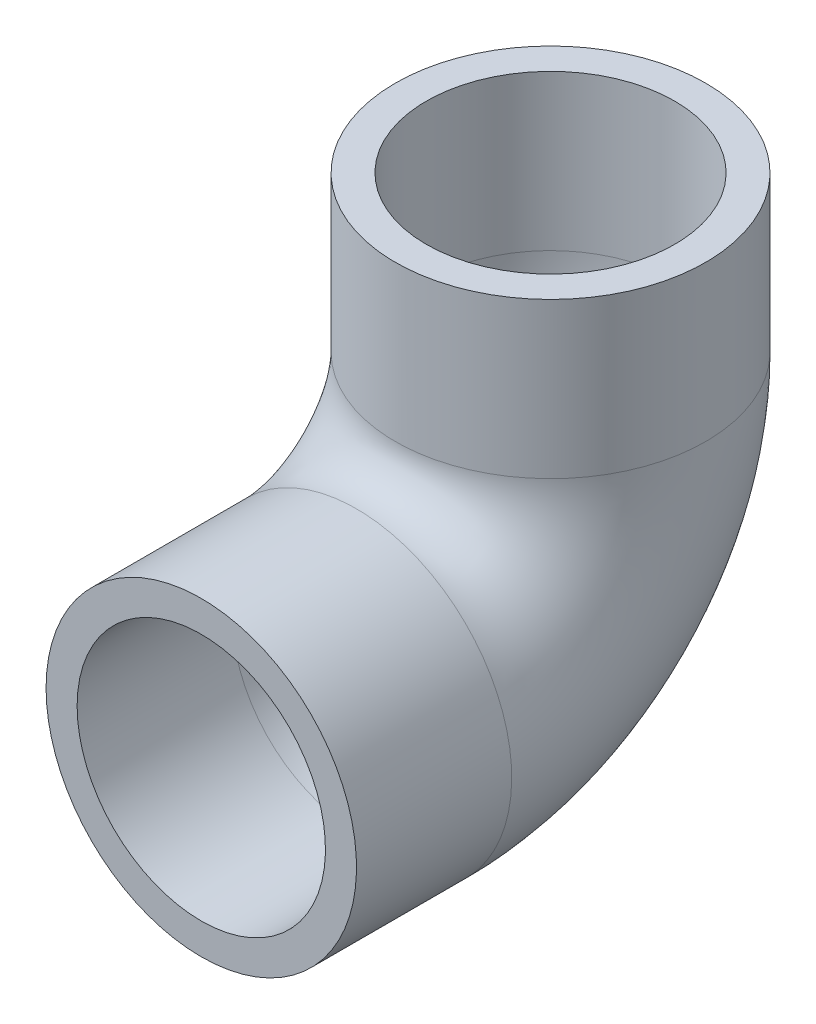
ISO-10303-21;
HEADER;
FILE_DESCRIPTION(('STEP AP214'),'2;1');
FILE_NAME('part.step','',(''),(''),'','','');
FILE_SCHEMA(('AUTOMOTIVE_DESIGN { 1 0 10303 214 1 1 1 1 }'));
ENDSEC;
DATA;
#1=APPLICATION_CONTEXT('core data for automotive mechanical design processes');
#2=APPLICATION_PROTOCOL_DEFINITION('international standard','automotive_design',2000,#1);
#3=PRODUCT_CONTEXT('',#1,'mechanical');
#4=PRODUCT('Part','Part','',(#3));
#5=PRODUCT_RELATED_PRODUCT_CATEGORY('part','',(#4));
#6=PRODUCT_DEFINITION_FORMATION('','',#4);
#7=PRODUCT_DEFINITION_CONTEXT('part definition',#1,'design');
#8=PRODUCT_DEFINITION('design','',#6,#7);
#9=PRODUCT_DEFINITION_SHAPE('','',#8);
#10=(LENGTH_UNIT() NAMED_UNIT(*) SI_UNIT(.MILLI.,.METRE.));
#11=(NAMED_UNIT(*) PLANE_ANGLE_UNIT() SI_UNIT($,.RADIAN.));
#12=(NAMED_UNIT(*) SI_UNIT($,.STERADIAN.) SOLID_ANGLE_UNIT());
#13=UNCERTAINTY_MEASURE_WITH_UNIT(LENGTH_MEASURE(1.E-05),#10,'distance_accuracy_value','');
#14=(GEOMETRIC_REPRESENTATION_CONTEXT(3) GLOBAL_UNCERTAINTY_ASSIGNED_CONTEXT((#13)) GLOBAL_UNIT_ASSIGNED_CONTEXT((#10,
#11,#12)) REPRESENTATION_CONTEXT('',''));
#15=CARTESIAN_POINT('',(0.,0.,0.));
#16=DIRECTION('',(0.,0.,1.));
#17=DIRECTION('',(1.,0.,0.));
#18=AXIS2_PLACEMENT_3D('',#15,#16,#17);
#19=CARTESIAN_POINT('',(0.,0.,0.));
#20=DIRECTION('',(0.,1.,0.));
#21=DIRECTION('',(-1.,0.,0.));
#22=AXIS2_PLACEMENT_3D('',#19,#20,#21);
#23=PLANE('',#22);
#24=CARTESIAN_POINT('',(0.,0.,0.));
#25=DIRECTION('',(0.,1.,0.));
#26=DIRECTION('',(0.,0.,1.));
#27=AXIS2_PLACEMENT_3D('',#24,#25,#26);
#28=CIRCLE('',#27,40.64);
#29=CARTESIAN_POINT('',(0.,0.,40.64));
#30=VERTEX_POINT('',#29);
#31=EDGE_CURVE('E71',#30,#30,#28,.T.);
#32=ORIENTED_EDGE('',*,*,#31,.F.);
#33=EDGE_LOOP('',(#32));
#34=FACE_BOUND('',#33,.T.);
#35=CARTESIAN_POINT('',(0.,0.,0.));
#36=DIRECTION('',(0.,1.,0.));
#37=DIRECTION('',(-1.,0.,0.));
#38=AXIS2_PLACEMENT_3D('',#35,#36,#37);
#39=CIRCLE('',#38,50.8);
#40=CARTESIAN_POINT('',(-50.8,0.,0.));
#41=VERTEX_POINT('',#40);
#42=EDGE_CURVE('E62',#41,#41,#39,.T.);
#43=ORIENTED_EDGE('',*,*,#42,.T.);
#44=EDGE_LOOP('',(#43));
#45=FACE_BOUND('',#44,.T.);
#46=ADVANCED_FACE('F48',(#34,#45),#23,.T.);
#47=CARTESIAN_POINT('',(0.,-114.3,114.3));
#48=DIRECTION('',(0.,0.,-1.));
#49=DIRECTION('',(-1.,0.,0.));
#50=AXIS2_PLACEMENT_3D('',#47,#48,#49);
#51=PLANE('',#50);
#52=CARTESIAN_POINT('',(0.,-114.3,114.3));
#53=DIRECTION('',(0.,0.,-1.));
#54=DIRECTION('',(-1.,0.,0.));
#55=AXIS2_PLACEMENT_3D('',#52,#53,#54);
#56=CIRCLE('',#55,40.64);
#57=CARTESIAN_POINT('',(-40.64,-114.3,114.3));
#58=VERTEX_POINT('',#57);
#59=EDGE_CURVE('E67',#58,#58,#56,.T.);
#60=ORIENTED_EDGE('',*,*,#59,.T.);
#61=EDGE_LOOP('',(#60));
#62=FACE_BOUND('',#61,.T.);
#63=CARTESIAN_POINT('',(0.,-114.3,114.3));
#64=DIRECTION('',(0.,0.,-1.));
#65=DIRECTION('',(-1.,0.,0.));
#66=AXIS2_PLACEMENT_3D('',#63,#64,#65);
#67=CIRCLE('',#66,50.8);
#68=CARTESIAN_POINT('',(-50.8,-114.3,114.3));
#69=VERTEX_POINT('',#68);
#70=EDGE_CURVE('E11',#69,#69,#67,.T.);
#71=ORIENTED_EDGE('',*,*,#70,.F.);
#72=EDGE_LOOP('',(#71));
#73=FACE_BOUND('',#72,.T.);
#74=ADVANCED_FACE('F91',(#62,#73),#51,.F.);
#75=CARTESIAN_POINT('',(0.,0.,0.));
#76=DIRECTION('',(0.,-1.,0.));
#77=DIRECTION('',(0.,0.,-1.));
#78=AXIS2_PLACEMENT_3D('',#75,#76,#77);
#79=CYLINDRICAL_SURFACE('',#78,50.8);
#80=CARTESIAN_POINT('',(0.,-50.8,0.));
#81=DIRECTION('',(0.,1.,0.));
#82=DIRECTION('',(-1.,0.,0.));
#83=AXIS2_PLACEMENT_3D('',#80,#81,#82);
#84=CIRCLE('',#83,50.8);
#85=CARTESIAN_POINT('',(0.,-50.8,-50.8));
#86=VERTEX_POINT('',#85);
#87=EDGE_CURVE('E58',#86,#86,#84,.T.);
#88=ORIENTED_EDGE('',*,*,#87,.T.);
#89=EDGE_LOOP('',(#88));
#90=FACE_BOUND('',#89,.T.);
#91=ORIENTED_EDGE('',*,*,#42,.F.);
#92=EDGE_LOOP('',(#91));
#93=FACE_BOUND('',#92,.T.);
#94=ADVANCED_FACE('F95',(#90,#93),#79,.T.);
#95=CARTESIAN_POINT('',(0.,-50.8,63.5));
#96=DIRECTION('',(-1.,0.,0.));
#97=DIRECTION('',(0.,0.,1.));
#98=AXIS2_PLACEMENT_3D('',#95,#96,#97);
#99=TOROIDAL_SURFACE('',#98,63.5,50.8);
#100=CARTESIAN_POINT('',(0.,-114.3,63.5));
#101=DIRECTION('',(0.,0.,-1.));
#102=DIRECTION('',(-1.,0.,0.));
#103=AXIS2_PLACEMENT_3D('',#100,#101,#102);
#104=CIRCLE('',#103,50.8);
#105=CARTESIAN_POINT('',(0.,-165.1,63.5000000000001));
#106=VERTEX_POINT('',#105);
#107=EDGE_CURVE('E54',#106,#106,#104,.T.);
#108=CARTESIAN_POINT('',(0.,-50.8,63.5));
#109=DIRECTION('',(-1.,0.,0.));
#110=DIRECTION('',(0.,0.,1.));
#111=AXIS2_PLACEMENT_3D('',#108,#109,#110);
#112=CIRCLE('',#111,114.3);
#113=EDGE_CURVE('',#86,#106,#112,.T.);
#114=ORIENTED_EDGE('',*,*,#87,.F.);
#115=ORIENTED_EDGE('',*,*,#107,.T.);
#116=ORIENTED_EDGE('',*,*,#113,.T.);
#117=ORIENTED_EDGE('',*,*,#113,.F.);
#118=EDGE_LOOP('',(#114,#116,#115,#117));
#119=FACE_BOUND('',#118,.T.);
#120=ADVANCED_FACE('F97',(#119),#99,.T.);
#121=CARTESIAN_POINT('',(0.,-114.3,63.5));
#122=DIRECTION('',(0.,0.,1.));
#123=DIRECTION('',(1.,0.,0.));
#124=AXIS2_PLACEMENT_3D('',#121,#122,#123);
#125=CYLINDRICAL_SURFACE('',#124,50.8);
#126=ORIENTED_EDGE('',*,*,#70,.T.);
#127=EDGE_LOOP('',(#126));
#128=FACE_BOUND('',#127,.T.);
#129=ORIENTED_EDGE('',*,*,#107,.F.);
#130=EDGE_LOOP('',(#129));
#131=FACE_BOUND('',#130,.T.);
#132=ADVANCED_FACE('F85',(#128,#131),#125,.T.);
#133=CARTESIAN_POINT('',(0.,0.,0.));
#134=DIRECTION('',(0.,-1.,0.));
#135=DIRECTION('',(0.,0.,-1.));
#136=AXIS2_PLACEMENT_3D('',#133,#134,#135);
#137=CYLINDRICAL_SURFACE('',#136,40.64);
#138=CARTESIAN_POINT('',(0.,-50.8,0.));
#139=DIRECTION('',(0.,-1.,0.));
#140=DIRECTION('',(0.,0.,-1.));
#141=AXIS2_PLACEMENT_3D('',#138,#139,#140);
#142=CIRCLE('',#141,40.64);
#143=CARTESIAN_POINT('',(0.,-50.8,-40.64));
#144=VERTEX_POINT('',#143);
#145=EDGE_CURVE('E74',#144,#144,#142,.F.);
#146=ORIENTED_EDGE('',*,*,#145,.F.);
#147=EDGE_LOOP('',(#146));
#148=FACE_BOUND('',#147,.T.);
#149=ORIENTED_EDGE('',*,*,#31,.T.);
#150=EDGE_LOOP('',(#149));
#151=FACE_BOUND('',#150,.T.);
#152=ADVANCED_FACE('F82',(#148,#151),#137,.F.);
#153=CARTESIAN_POINT('',(0.,-50.8,63.5));
#154=DIRECTION('',(-1.,0.,0.));
#155=DIRECTION('',(0.,0.,1.));
#156=AXIS2_PLACEMENT_3D('',#153,#154,#155);
#157=TOROIDAL_SURFACE('',#156,63.5,40.64);
#158=CARTESIAN_POINT('',(0.,-114.3,63.5));
#159=DIRECTION('',(0.,0.,-1.));
#160=DIRECTION('',(0.,1.,0.));
#161=AXIS2_PLACEMENT_3D('',#158,#159,#160);
#162=CIRCLE('',#161,40.64);
#163=CARTESIAN_POINT('',(0.,-154.94,63.5));
#164=VERTEX_POINT('',#163);
#165=EDGE_CURVE('E70',#164,#164,#162,.T.);
#166=CARTESIAN_POINT('',(0.,-50.8,63.5));
#167=DIRECTION('',(-1.,0.,0.));
#168=DIRECTION('',(0.,0.,1.));
#169=AXIS2_PLACEMENT_3D('',#166,#167,#168);
#170=CIRCLE('',#169,104.14);
#171=EDGE_CURVE('',#144,#164,#170,.T.);
#172=ORIENTED_EDGE('',*,*,#145,.T.);
#173=ORIENTED_EDGE('',*,*,#165,.F.);
#174=ORIENTED_EDGE('',*,*,#171,.T.);
#175=ORIENTED_EDGE('',*,*,#171,.F.);
#176=EDGE_LOOP('',(#172,#174,#173,#175));
#177=FACE_BOUND('',#176,.T.);
#178=ADVANCED_FACE('F80',(#177),#157,.F.);
#179=CARTESIAN_POINT('',(0.,-114.3,63.5));
#180=DIRECTION('',(0.,0.,1.));
#181=DIRECTION('',(1.,0.,0.));
#182=AXIS2_PLACEMENT_3D('',#179,#180,#181);
#183=CYLINDRICAL_SURFACE('',#182,40.64);
#184=ORIENTED_EDGE('',*,*,#59,.F.);
#185=EDGE_LOOP('',(#184));
#186=FACE_BOUND('',#185,.T.);
#187=ORIENTED_EDGE('',*,*,#165,.T.);
#188=EDGE_LOOP('',(#187));
#189=FACE_BOUND('',#188,.T.);
#190=ADVANCED_FACE('F92',(#186,#189),#183,.F.);
#191=CLOSED_SHELL('',(#46,#74,#94,#120,#132,#152,#178,#190));
#192=MANIFOLD_SOLID_BREP('B2',#191);
#193=ADVANCED_BREP_SHAPE_REPRESENTATION('',(#18,#192),#14);
#194=SHAPE_DEFINITION_REPRESENTATION(#9,#193);
ENDSEC;
END-ISO-10303-21;
